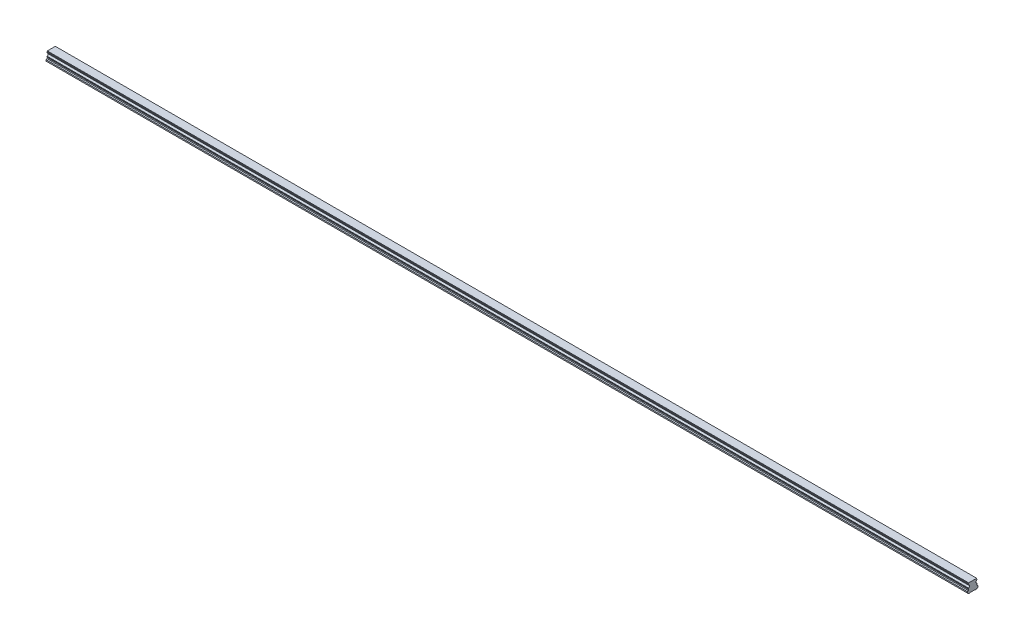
from build123d import *

# Parameters (mm, degrees)
BOSS_EXTRUDE1_DEPTH        = 2160
SKETCH3_R                  = 3
SKETCH3_R_2                = 2.5
CUT_EXTRUDE3_DEPTH         = 12
SKETCH3_2_R                = 2.5
CUT_EXTRUDE4_DEPTH         = 15
CHAMFER1_SIZE              = 0.5
LPATTERN4_COUNT            = 36
LPATTERN4_PITCH            = 60
CHAMFER1_OF_LPATTERN4_SIZE = 0.5


with BuildPart() as part:
    # Sketch1 → Boss-Extrude1 (new body)
    with BuildSketch(Plane(origin=(0, 0, 0), x_dir=(0, 0, -1), z_dir=(1, 0, 0))):
        with BuildLine():
            Line((9.375, 21.8), (-9.375, 21.8))
            Line((-9.375, 21.8), (-9.375, 20.756))
            Line((-9.375, 20.756), (-10, 19.415683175))
            Line((-10, 19.415683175), (-10, 17.685449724))
            ThreePointArc((-10, 17.685449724), (-7.2, 14.6), (-10, 11.514550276))
            Line((-10, 11.514550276), (-10, 9.784316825))
            Line((-10, 9.784316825), (-9.375, 8.444))
            Line((-9.375, 8.444), (-9.922688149, 6.4))
            Line((-9.922688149, 6.4), (-12.5, 5.489338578))
            Line((-12.5, 5.489338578), (-12.5, 2.65))
            Line((-12.5, 2.65), (-9.85, 0))
            Line((-9.85, 0), (-5.5, 0))
            Line((-5.5, 0), (-5, 0.5))
            Line((-5, 0.5), (5, 0.5))
            Line((5, 0.5), (5.5, 0))
            Line((5.5, 0), (9.85, 0))
            Line((9.85, 0), (12.5, 2.65))
            Line((12.5, 2.65), (12.5, 5.489338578))
            Line((12.5, 5.489338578), (9.922688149, 6.4))
            Line((9.922688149, 6.4), (9.375, 8.444))
            Line((9.375, 8.444), (10, 9.784316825))
            Line((10, 9.784316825), (10, 11.514550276))
            ThreePointArc((10, 11.514550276), (7.2, 14.6), (10, 17.685449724))
            Line((10, 17.685449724), (10, 19.415683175))
            Line((10, 19.415683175), (9.375, 20.756))
            Line((9.375, 20.756), (9.375, 21.8))
        make_face()
    extrude(amount=BOSS_EXTRUDE1_DEPTH)

    # Sketch3 → Cut-Extrude3 (cut)
    with BuildSketch(Plane.XZ):
        with Locations(Location((30, 0, 0), (0, 0, 270))):
            Circle(SKETCH3_R)
        with Locations(Location((30, 0, 0), (0, 0, 270))):
            Circle(SKETCH3_R_2, mode=Mode.SUBTRACT)
    cut_extrude3 = extrude(amount=-CUT_EXTRUDE3_DEPTH, mode=Mode.SUBTRACT)

    # Sketch3_2 → Cut-Extrude4 (cut)
    with BuildSketch(Plane.XZ):
        with Locations(Location((30, 0, 0), (0, 0, 270))):
            Circle(SKETCH3_2_R)
    cut_extrude4 = extrude(amount=-CUT_EXTRUDE4_DEPTH, mode=Mode.SUBTRACT)

    # Cut-Extrude5 cone 1 section (on through the dimple's axis) → Cut-Extrude5 (revolve, cut)
    with BuildSketch(Plane(origin=(30, 15, 0), x_dir=(0, 0, -1), z_dir=(1, 0, 0))):
        Polygon((0, 0), (2.5, 0), (0, 1.443375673), align=None)
    cut_extrude5 = revolve(axis=Axis((30, 15, 0), (0, 1, 0)), mode=Mode.SUBTRACT)

    # Chamfer1
    chamfer1_edges = [part.edges().sort_by_distance(p)[0] for p in [
        (30, 0.5, 3),
    ]]
    chamfer(chamfer1_edges, length=CHAMFER1_SIZE)

    # LPattern4: Cut-Extrude3, Cut-Extrude4, Cut-Extrude5 ×36
    with Locations(*[(i * LPATTERN4_PITCH, 0, 0) for i in range(1, LPATTERN4_COUNT)]):
        add(cut_extrude3, mode=Mode.SUBTRACT)
        add(cut_extrude4, mode=Mode.SUBTRACT)
        add(cut_extrude5, mode=Mode.SUBTRACT)

    # Chamfer1 of LPattern4
    chamfer1_of_lpattern4_edges = [part.edges().sort_by_distance(p)[0] for p in [
        (90, 0.5, 3),
        (150, 0.5, 3),
        (210, 0.5, 3),
        (270, 0.5, 3),
        (330, 0.5, 3),
        (390, 0.5, 3),
        (450, 0.5, 3),
        (510, 0.5, 3),
        (570, 0.5, 3),
        (630, 0.5, 3),
        (690, 0.5, 3),
        (750, 0.5, 3),
        (810, 0.5, 3),
        (870, 0.5, 3),
        (930, 0.5, 3),
        (990, 0.5, 3),
        (1050, 0.5, 3),
        (1110, 0.5, 3),
        (1170, 0.5, 3),
        (1230, 0.5, 3),
        (1290, 0.5, 3),
        (1350, 0.5, 3),
        (1410, 0.5, 3),
        (1470, 0.5, 3),
        (1530, 0.5, 3),
        (1590, 0.5, 3),
        (1650, 0.5, 3),
        (1710, 0.5, 3),
        (1770, 0.5, 3),
        (1830, 0.5, 3),
        (1890, 0.5, 3),
        (1950, 0.5, 3),
        (2010, 0.5, 3),
        (2070, 0.5, 3),
        (2130, 0.5, 3),
    ]]
    chamfer(chamfer1_of_lpattern4_edges, length=CHAMFER1_OF_LPATTERN4_SIZE)


solid = part.part
